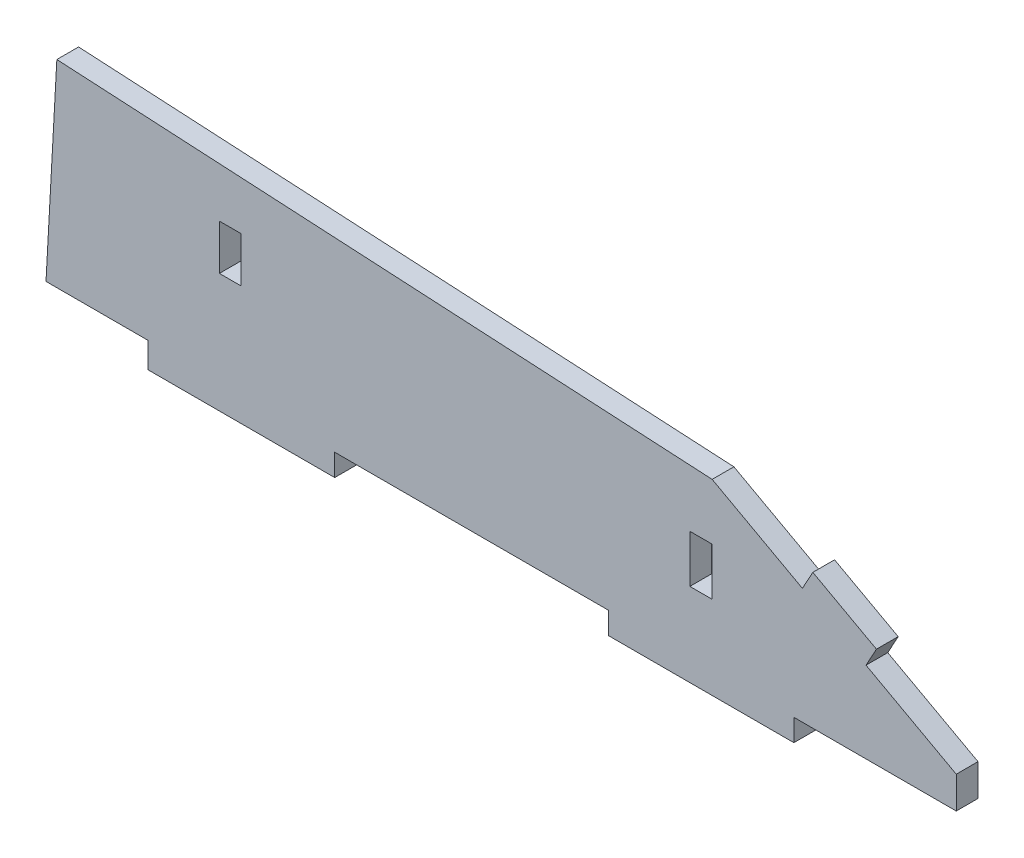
from build123d import *

# Parameters (mm, degrees)
SKETCH1_W           = 1.564202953
SKETCH1_H           = 3.346303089
SKETCH1_W_2         = 1.524
SKETCH1_H_2         = 3.1751196
BOSS_EXTRUDE1_DEPTH = 1.524


with BuildPart() as part:
    # Sketch1 → Boss-Extrude1 (new body)
    with BuildSketch(Plane.XY):
        Polygon((-13.677596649, -7.363581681), (-6.526717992, -7.363581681), (-6.526717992, -9.150984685), (6.557809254, -9.150984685), (6.557809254, -7.610388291), (25.744231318, -7.610388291), (25.744231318, -9.150984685), (38.74228705, -9.150984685), (38.74228705, -7.610388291), (50.123119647, -7.610388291), (50.123119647, -5.373104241), (43.797807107, -1.919304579), (44.528169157, -0.581714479), (40.069535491, 1.852825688), (39.33917344, 0.515235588), (33.0138609, 3.96903525), (-12.91768233, 6.488756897), align=None)
        with Locations((32.231759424, -1.637483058)):
            Rectangle(SKETCH1_W, SKETCH1_H, mode=Mode.SUBTRACT)
        with Locations((-0.762, 0.788429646)):
            Rectangle(SKETCH1_W_2, SKETCH1_H_2, mode=Mode.SUBTRACT)
    extrude(amount=BOSS_EXTRUDE1_DEPTH)


solid = part.part
